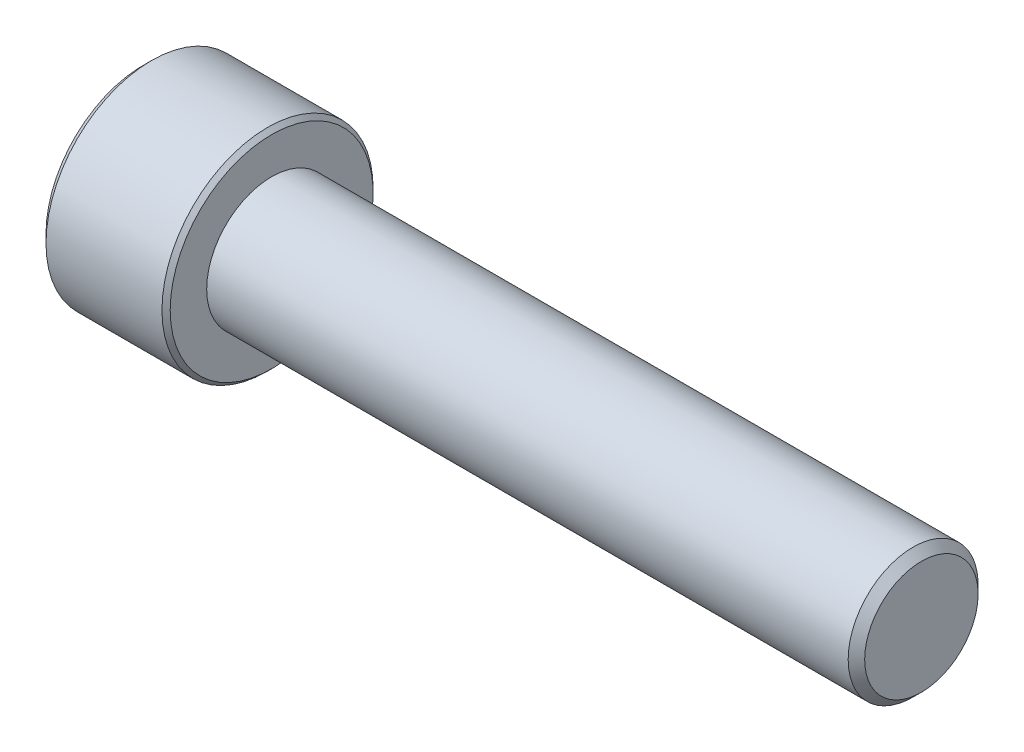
from build123d import *

# Parameters (mm, degrees)
CUT_EXTRUDE1_DEPTH = 3.556
CHAMFER1_SIZE      = 0.508
CHAMFER2_SIZE      = 0.254


with BuildPart() as part:
    # Sketch2 → Revolve1 (revolve)
    with BuildSketch(Plane.XY, mode=Mode.PRIVATE) as revolve1_sk:
        Polygon((-7.9, 0), (40, 0), (40, 4), (0, 4), (0, 6.5), (-7.9, 6.5), align=None)
    revolve(revolve1_sk.sketch.rotate(Axis((-7.9, 0, 0), (1, 0, 0)), 90), axis=Axis((-7.9, 0, 0), (1, 0, 0)))

    # Sketch3 → Cut-Extrude1 (cut)
    with BuildSketch(Plane.ZY.offset(7.9)):
        Polygon((-1.732050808, -3), (1.732050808, -3), (3.464101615, 0), (1.732050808, 3), (-1.732050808, 3), (-3.464101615, 0), align=None)
    extrude(amount=-CUT_EXTRUDE1_DEPTH, mode=Mode.SUBTRACT)

    # Chamfer1
    chamfer1_edges = [part.edges().sort_by_distance(p)[0] for p in [
        (-7.9, 0, -6.5),
        (40, 0, -4),
    ]]
    chamfer(chamfer1_edges, length=CHAMFER1_SIZE)

    # Chamfer2
    chamfer2_edges = [part.edges().sort_by_distance(p)[0] for p in [
        (0, 0, -6.5),
    ]]
    chamfer(chamfer2_edges, length=CHAMFER2_SIZE)


solid = part.part
